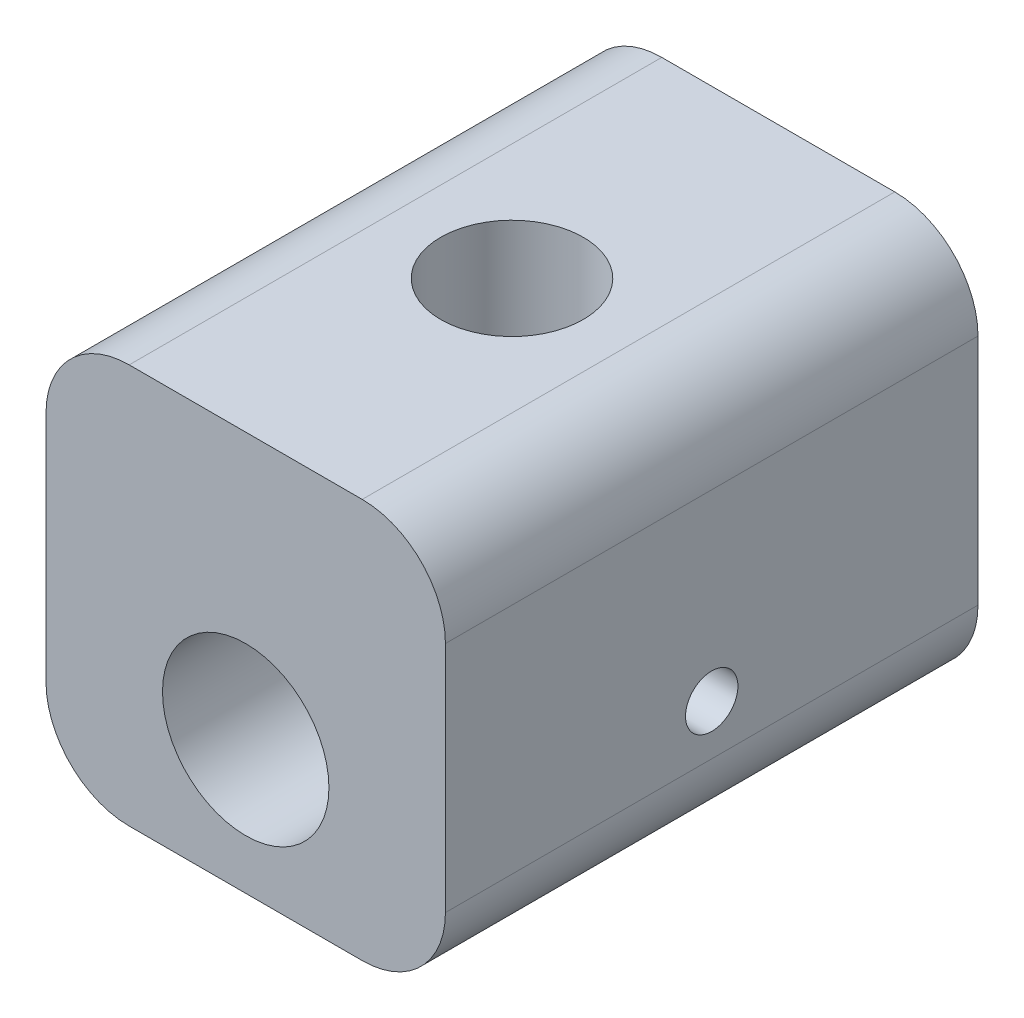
ISO-10303-21;
HEADER;
FILE_DESCRIPTION(('STEP AP214'),'2;1');
FILE_NAME('part.step','',(''),(''),'','','');
FILE_SCHEMA(('AUTOMOTIVE_DESIGN { 1 0 10303 214 1 1 1 1 }'));
ENDSEC;
DATA;
#1=APPLICATION_CONTEXT('core data for automotive mechanical design processes');
#2=APPLICATION_PROTOCOL_DEFINITION('international standard','automotive_design',2000,#1);
#3=PRODUCT_CONTEXT('',#1,'mechanical');
#4=PRODUCT('Part','Part','',(#3));
#5=PRODUCT_RELATED_PRODUCT_CATEGORY('part','',(#4));
#6=PRODUCT_DEFINITION_FORMATION('','',#4);
#7=PRODUCT_DEFINITION_CONTEXT('part definition',#1,'design');
#8=PRODUCT_DEFINITION('design','',#6,#7);
#9=PRODUCT_DEFINITION_SHAPE('','',#8);
#10=(LENGTH_UNIT() NAMED_UNIT(*) SI_UNIT(.MILLI.,.METRE.));
#11=(NAMED_UNIT(*) PLANE_ANGLE_UNIT() SI_UNIT($,.RADIAN.));
#12=(NAMED_UNIT(*) SI_UNIT($,.STERADIAN.) SOLID_ANGLE_UNIT());
#13=UNCERTAINTY_MEASURE_WITH_UNIT(LENGTH_MEASURE(1.E-05),#10,'distance_accuracy_value','');
#14=(GEOMETRIC_REPRESENTATION_CONTEXT(3) GLOBAL_UNCERTAINTY_ASSIGNED_CONTEXT((#13)) GLOBAL_UNIT_ASSIGNED_CONTEXT((#10,
#11,#12)) REPRESENTATION_CONTEXT('',''));
#15=CARTESIAN_POINT('',(0.,0.,0.));
#16=DIRECTION('',(0.,0.,1.));
#17=DIRECTION('',(1.,0.,0.));
#18=AXIS2_PLACEMENT_3D('',#15,#16,#17);
#19=CARTESIAN_POINT('',(0.,0.,25.4));
#20=DIRECTION('',(0.,0.,1.));
#21=DIRECTION('',(1.,0.,0.));
#22=AXIS2_PLACEMENT_3D('',#19,#20,#21);
#23=PLANE('',#22);
#24=DIRECTION('',(1.,0.,0.));
#25=VECTOR('',#24,1.);
#26=CARTESIAN_POINT('',(-9.525,-6.35,25.4));
#27=LINE('',#26,#25);
#28=CARTESIAN_POINT('',(-5.55625,-6.35,25.4));
#29=VERTEX_POINT('',#28);
#30=CARTESIAN_POINT('',(5.55625,-6.35,25.4));
#31=VERTEX_POINT('',#30);
#32=EDGE_CURVE('E169',#29,#31,#27,.T.);
#33=ORIENTED_EDGE('',*,*,#32,.T.);
#34=CARTESIAN_POINT('',(5.55625,-2.38125,25.4));
#35=DIRECTION('',(0.,0.,1.));
#36=DIRECTION('',(1.,0.,0.));
#37=AXIS2_PLACEMENT_3D('',#34,#35,#36);
#38=CIRCLE('',#37,3.96875);
#39=CARTESIAN_POINT('',(9.525,-2.38125,25.4));
#40=VERTEX_POINT('',#39);
#41=EDGE_CURVE('E147',#31,#40,#38,.T.);
#42=ORIENTED_EDGE('',*,*,#41,.T.);
#43=DIRECTION('',(0.,1.,0.));
#44=VECTOR('',#43,1.);
#45=CARTESIAN_POINT('',(9.525,12.7,25.4));
#46=LINE('',#45,#44);
#47=CARTESIAN_POINT('',(9.525,8.73125,25.4));
#48=VERTEX_POINT('',#47);
#49=EDGE_CURVE('E117',#40,#48,#46,.T.);
#50=ORIENTED_EDGE('',*,*,#49,.T.);
#51=CARTESIAN_POINT('',(5.55625,8.73125,25.4));
#52=DIRECTION('',(0.,0.,1.));
#53=DIRECTION('',(1.,0.,0.));
#54=AXIS2_PLACEMENT_3D('',#51,#52,#53);
#55=CIRCLE('',#54,3.96875);
#56=CARTESIAN_POINT('',(5.55625,12.7,25.4));
#57=VERTEX_POINT('',#56);
#58=EDGE_CURVE('E53',#48,#57,#55,.T.);
#59=ORIENTED_EDGE('',*,*,#58,.T.);
#60=DIRECTION('',(-1.,0.,0.));
#61=VECTOR('',#60,1.);
#62=CARTESIAN_POINT('',(-9.525,12.7,25.4));
#63=LINE('',#62,#61);
#64=CARTESIAN_POINT('',(-5.55625,12.7,25.4));
#65=VERTEX_POINT('',#64);
#66=EDGE_CURVE('E133',#57,#65,#63,.T.);
#67=ORIENTED_EDGE('',*,*,#66,.T.);
#68=CARTESIAN_POINT('',(-5.55625,8.73125,25.4));
#69=DIRECTION('',(0.,0.,1.));
#70=DIRECTION('',(1.,0.,0.));
#71=AXIS2_PLACEMENT_3D('',#68,#69,#70);
#72=CIRCLE('',#71,3.96875);
#73=CARTESIAN_POINT('',(-9.525,8.73125,25.4));
#74=VERTEX_POINT('',#73);
#75=EDGE_CURVE('E143',#65,#74,#72,.T.);
#76=ORIENTED_EDGE('',*,*,#75,.T.);
#77=DIRECTION('',(0.,-1.,0.));
#78=VECTOR('',#77,1.);
#79=CARTESIAN_POINT('',(-9.525,12.7,25.4));
#80=LINE('',#79,#78);
#81=CARTESIAN_POINT('',(-9.525,-2.38125,25.4));
#82=VERTEX_POINT('',#81);
#83=EDGE_CURVE('E127',#74,#82,#80,.T.);
#84=ORIENTED_EDGE('',*,*,#83,.T.);
#85=CARTESIAN_POINT('',(-5.55625,-2.38125,25.4));
#86=DIRECTION('',(0.,0.,1.));
#87=DIRECTION('',(1.,0.,0.));
#88=AXIS2_PLACEMENT_3D('',#85,#86,#87);
#89=CIRCLE('',#88,3.96875);
#90=EDGE_CURVE('E145',#82,#29,#89,.T.);
#91=ORIENTED_EDGE('',*,*,#90,.T.);
#92=EDGE_LOOP('',(#33,#42,#50,#59,#67,#76,#84,#91));
#93=FACE_BOUND('',#92,.T.);
#94=CARTESIAN_POINT('',(0.,0.,25.4));
#95=DIRECTION('',(0.,0.,1.));
#96=DIRECTION('',(1.,0.,0.));
#97=AXIS2_PLACEMENT_3D('',#94,#95,#96);
#98=CIRCLE('',#97,3.96875);
#99=CARTESIAN_POINT('',(3.96875,0.,25.4));
#100=VERTEX_POINT('',#99);
#101=EDGE_CURVE('E178',#100,#100,#98,.T.);
#102=ORIENTED_EDGE('',*,*,#101,.F.);
#103=EDGE_LOOP('',(#102));
#104=FACE_BOUND('',#103,.T.);
#105=ADVANCED_FACE('F33',(#93,#104),#23,.T.);
#106=CARTESIAN_POINT('',(0.,0.,0.));
#107=DIRECTION('',(0.,0.,1.));
#108=DIRECTION('',(1.,0.,0.));
#109=AXIS2_PLACEMENT_3D('',#106,#107,#108);
#110=PLANE('',#109);
#111=DIRECTION('',(0.,1.,0.));
#112=VECTOR('',#111,1.);
#113=CARTESIAN_POINT('',(9.525,12.7,0.));
#114=LINE('',#113,#112);
#115=CARTESIAN_POINT('',(9.525,-2.38125,0.));
#116=VERTEX_POINT('',#115);
#117=CARTESIAN_POINT('',(9.525,8.73125,0.));
#118=VERTEX_POINT('',#117);
#119=EDGE_CURVE('E115',#116,#118,#114,.T.);
#120=ORIENTED_EDGE('',*,*,#119,.F.);
#121=CARTESIAN_POINT('',(5.55625,-2.38125,0.));
#122=DIRECTION('',(0.,0.,1.));
#123=DIRECTION('',(1.,0.,0.));
#124=AXIS2_PLACEMENT_3D('',#121,#122,#123);
#125=CIRCLE('',#124,3.96875);
#126=CARTESIAN_POINT('',(5.55625,-6.35,0.));
#127=VERTEX_POINT('',#126);
#128=EDGE_CURVE('E98',#116,#127,#125,.F.);
#129=ORIENTED_EDGE('',*,*,#128,.T.);
#130=DIRECTION('',(1.,0.,0.));
#131=VECTOR('',#130,1.);
#132=CARTESIAN_POINT('',(-9.525,-6.35,0.));
#133=LINE('',#132,#131);
#134=CARTESIAN_POINT('',(-5.55625,-6.35,0.));
#135=VERTEX_POINT('',#134);
#136=EDGE_CURVE('E125',#135,#127,#133,.T.);
#137=ORIENTED_EDGE('',*,*,#136,.F.);
#138=CARTESIAN_POINT('',(-5.55625,-2.38125,0.));
#139=DIRECTION('',(0.,0.,1.));
#140=DIRECTION('',(1.,0.,0.));
#141=AXIS2_PLACEMENT_3D('',#138,#139,#140);
#142=CIRCLE('',#141,3.96875);
#143=CARTESIAN_POINT('',(-9.525,-2.38125,0.));
#144=VERTEX_POINT('',#143);
#145=EDGE_CURVE('E109',#135,#144,#142,.F.);
#146=ORIENTED_EDGE('',*,*,#145,.T.);
#147=DIRECTION('',(0.,-1.,0.));
#148=VECTOR('',#147,1.);
#149=CARTESIAN_POINT('',(-9.525,12.7,0.));
#150=LINE('',#149,#148);
#151=CARTESIAN_POINT('',(-9.525,8.73125,0.));
#152=VERTEX_POINT('',#151);
#153=EDGE_CURVE('E129',#152,#144,#150,.T.);
#154=ORIENTED_EDGE('',*,*,#153,.F.);
#155=CARTESIAN_POINT('',(-5.55625,8.73125,0.));
#156=DIRECTION('',(0.,0.,1.));
#157=DIRECTION('',(1.,0.,0.));
#158=AXIS2_PLACEMENT_3D('',#155,#156,#157);
#159=CIRCLE('',#158,3.96875);
#160=CARTESIAN_POINT('',(-5.55625,12.7,0.));
#161=VERTEX_POINT('',#160);
#162=EDGE_CURVE('E136',#152,#161,#159,.F.);
#163=ORIENTED_EDGE('',*,*,#162,.T.);
#164=DIRECTION('',(-1.,0.,0.));
#165=VECTOR('',#164,1.);
#166=CARTESIAN_POINT('',(-9.525,12.7,0.));
#167=LINE('',#166,#165);
#168=CARTESIAN_POINT('',(5.55625,12.7,0.));
#169=VERTEX_POINT('',#168);
#170=EDGE_CURVE('E124',#169,#161,#167,.T.);
#171=ORIENTED_EDGE('',*,*,#170,.F.);
#172=CARTESIAN_POINT('',(5.55625,8.73125,0.));
#173=DIRECTION('',(0.,0.,1.));
#174=DIRECTION('',(1.,0.,0.));
#175=AXIS2_PLACEMENT_3D('',#172,#173,#174);
#176=CIRCLE('',#175,3.96875);
#177=EDGE_CURVE('E118',#169,#118,#176,.F.);
#178=ORIENTED_EDGE('',*,*,#177,.T.);
#179=EDGE_LOOP('',(#120,#129,#137,#146,#154,#163,#171,#178));
#180=FACE_BOUND('',#179,.T.);
#181=CARTESIAN_POINT('',(0.,0.,0.));
#182=DIRECTION('',(0.,0.,1.));
#183=DIRECTION('',(1.,0.,0.));
#184=AXIS2_PLACEMENT_3D('',#181,#182,#183);
#185=CIRCLE('',#184,3.96875);
#186=CARTESIAN_POINT('',(3.96875,0.,0.));
#187=VERTEX_POINT('',#186);
#188=EDGE_CURVE('E174',#187,#187,#185,.T.);
#189=ORIENTED_EDGE('',*,*,#188,.T.);
#190=EDGE_LOOP('',(#189));
#191=FACE_BOUND('',#190,.T.);
#192=ADVANCED_FACE('F121',(#180,#191),#110,.F.);
#193=CARTESIAN_POINT('',(-9.525,12.7,25.4));
#194=DIRECTION('',(1.,0.,0.));
#195=DIRECTION('',(0.,1.,0.));
#196=AXIS2_PLACEMENT_3D('',#193,#194,#195);
#197=PLANE('',#196);
#198=ORIENTED_EDGE('',*,*,#153,.T.);
#199=DIRECTION('',(0.,0.,-1.));
#200=VECTOR('',#199,1.);
#201=CARTESIAN_POINT('',(-9.525,-2.38125,25.4));
#202=LINE('',#201,#200);
#203=EDGE_CURVE('E152',#144,#82,#202,.F.);
#204=ORIENTED_EDGE('',*,*,#203,.T.);
#205=ORIENTED_EDGE('',*,*,#83,.F.);
#206=DIRECTION('',(0.,0.,-1.));
#207=VECTOR('',#206,1.);
#208=CARTESIAN_POINT('',(-9.525,8.73125,25.4));
#209=LINE('',#208,#207);
#210=EDGE_CURVE('E149',#74,#152,#209,.T.);
#211=ORIENTED_EDGE('',*,*,#210,.T.);
#212=EDGE_LOOP('',(#198,#204,#205,#211));
#213=FACE_BOUND('',#212,.T.);
#214=ADVANCED_FACE('F165',(#213),#197,.F.);
#215=CARTESIAN_POINT('',(-9.525,-6.35,25.4));
#216=DIRECTION('',(0.,1.,0.));
#217=DIRECTION('',(0.,0.,1.));
#218=AXIS2_PLACEMENT_3D('',#215,#216,#217);
#219=PLANE('',#218);
#220=ORIENTED_EDGE('',*,*,#136,.T.);
#221=DIRECTION('',(0.,0.,-1.));
#222=VECTOR('',#221,1.);
#223=CARTESIAN_POINT('',(5.55625,-6.35,25.4));
#224=LINE('',#223,#222);
#225=EDGE_CURVE('E103',#127,#31,#224,.F.);
#226=ORIENTED_EDGE('',*,*,#225,.T.);
#227=ORIENTED_EDGE('',*,*,#32,.F.);
#228=DIRECTION('',(0.,0.,-1.));
#229=VECTOR('',#228,1.);
#230=CARTESIAN_POINT('',(-5.55625,-6.35,25.4));
#231=LINE('',#230,#229);
#232=EDGE_CURVE('E108',#29,#135,#231,.T.);
#233=ORIENTED_EDGE('',*,*,#232,.T.);
#234=EDGE_LOOP('',(#220,#226,#227,#233));
#235=FACE_BOUND('',#234,.T.);
#236=ADVANCED_FACE('F218',(#235),#219,.F.);
#237=CARTESIAN_POINT('',(9.525,12.7,25.4));
#238=DIRECTION('',(-1.,0.,0.));
#239=DIRECTION('',(0.,-1.,0.));
#240=AXIS2_PLACEMENT_3D('',#237,#238,#239);
#241=PLANE('',#240);
#242=CARTESIAN_POINT('',(9.525,0.,12.7));
#243=DIRECTION('',(1.,0.,0.));
#244=DIRECTION('',(0.,0.,-1.));
#245=AXIS2_PLACEMENT_3D('',#242,#243,#244);
#246=CIRCLE('',#245,1.25);
#247=CARTESIAN_POINT('',(9.525,0.,11.45));
#248=VERTEX_POINT('',#247);
#249=EDGE_CURVE('E211',#248,#248,#246,.T.);
#250=ORIENTED_EDGE('',*,*,#249,.F.);
#251=EDGE_LOOP('',(#250));
#252=FACE_BOUND('',#251,.T.);
#253=ORIENTED_EDGE('',*,*,#49,.F.);
#254=DIRECTION('',(0.,0.,-1.));
#255=VECTOR('',#254,1.);
#256=CARTESIAN_POINT('',(9.525,-2.38125,25.4));
#257=LINE('',#256,#255);
#258=EDGE_CURVE('E102',#40,#116,#257,.T.);
#259=ORIENTED_EDGE('',*,*,#258,.T.);
#260=ORIENTED_EDGE('',*,*,#119,.T.);
#261=DIRECTION('',(0.,0.,-1.));
#262=VECTOR('',#261,1.);
#263=CARTESIAN_POINT('',(9.525,8.73125,25.4));
#264=LINE('',#263,#262);
#265=EDGE_CURVE('E119',#118,#48,#264,.F.);
#266=ORIENTED_EDGE('',*,*,#265,.T.);
#267=EDGE_LOOP('',(#253,#259,#260,#266));
#268=FACE_BOUND('',#267,.T.);
#269=ADVANCED_FACE('F114',(#252,#268),#241,.F.);
#270=CARTESIAN_POINT('',(-9.525,12.7,25.4));
#271=DIRECTION('',(0.,-1.,0.));
#272=DIRECTION('',(0.,0.,-1.));
#273=AXIS2_PLACEMENT_3D('',#270,#271,#272);
#274=PLANE('',#273);
#275=CARTESIAN_POINT('',(0.,12.7,12.7));
#276=DIRECTION('',(0.,1.,0.));
#277=DIRECTION('',(0.,0.,1.));
#278=AXIS2_PLACEMENT_3D('',#275,#276,#277);
#279=CIRCLE('',#278,3.39999999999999);
#280=CARTESIAN_POINT('',(0.,12.7,16.1));
#281=VERTEX_POINT('',#280);
#282=EDGE_CURVE('E192',#281,#281,#279,.T.);
#283=ORIENTED_EDGE('',*,*,#282,.F.);
#284=EDGE_LOOP('',(#283));
#285=FACE_BOUND('',#284,.T.);
#286=ORIENTED_EDGE('',*,*,#170,.T.);
#287=DIRECTION('',(0.,0.,-1.));
#288=VECTOR('',#287,1.);
#289=CARTESIAN_POINT('',(-5.55625,12.7,25.4));
#290=LINE('',#289,#288);
#291=EDGE_CURVE('E11',#161,#65,#290,.F.);
#292=ORIENTED_EDGE('',*,*,#291,.T.);
#293=ORIENTED_EDGE('',*,*,#66,.F.);
#294=DIRECTION('',(0.,0.,-1.));
#295=VECTOR('',#294,1.);
#296=CARTESIAN_POINT('',(5.55625,12.7,25.4));
#297=LINE('',#296,#295);
#298=EDGE_CURVE('E41',#57,#169,#297,.T.);
#299=ORIENTED_EDGE('',*,*,#298,.T.);
#300=EDGE_LOOP('',(#286,#292,#293,#299));
#301=FACE_BOUND('',#300,.T.);
#302=ADVANCED_FACE('F155',(#285,#301),#274,.F.);
#303=CARTESIAN_POINT('',(0.,0.,25.4));
#304=DIRECTION('',(0.,0.,-1.));
#305=DIRECTION('',(-1.,0.,0.));
#306=AXIS2_PLACEMENT_3D('',#303,#304,#305);
#307=CYLINDRICAL_SURFACE('',#306,3.96875);
#308=CARTESIAN_POINT('',(3.96875,0.,11.45));
#309=CARTESIAN_POINT('',(3.96874971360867,-0.0684121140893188,11.4500003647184));
#310=CARTESIAN_POINT('',(3.96696444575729,-0.13682815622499,11.4556347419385));
#311=CARTESIAN_POINT('',(3.96001767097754,-0.271657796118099,11.4779631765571));
#312=CARTESIAN_POINT('',(3.95485544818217,-0.338070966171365,11.4946595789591));
#313=CARTESIAN_POINT('',(3.94171835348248,-0.466931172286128,11.5384919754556));
#314=CARTESIAN_POINT('',(3.93374787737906,-0.529384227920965,11.5656116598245));
#315=CARTESIAN_POINT('',(3.91581614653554,-0.648856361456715,11.6294509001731));
#316=CARTESIAN_POINT('',(3.90585456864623,-0.705874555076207,11.6661720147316));
#317=CARTESIAN_POINT('',(3.88464802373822,-0.814644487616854,11.7493821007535));
#318=CARTESIAN_POINT('',(3.87337476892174,-0.866202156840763,11.7961175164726));
#319=CARTESIAN_POINT('',(3.85097831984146,-0.960892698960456,11.8975049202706));
#320=CARTESIAN_POINT('',(3.83985515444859,-1.00402397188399,11.9521584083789));
#321=CARTESIAN_POINT('',(3.81871387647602,-1.08169602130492,12.069518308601));
#322=CARTESIAN_POINT('',(3.80873062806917,-1.11599322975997,12.1323927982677));
#323=CARTESIAN_POINT('',(3.7914255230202,-1.17344616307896,12.2633824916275));
#324=CARTESIAN_POINT('',(3.78410295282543,-1.19660487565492,12.3314962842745));
#325=CARTESIAN_POINT('',(3.77324441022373,-1.23041123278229,12.4688391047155));
#326=CARTESIAN_POINT('',(3.7695996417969,-1.2414193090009,12.5379705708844));
#327=CARTESIAN_POINT('',(3.76618649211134,-1.2517380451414,12.6771878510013));
#328=CARTESIAN_POINT('',(3.76641706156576,-1.25105187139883,12.7472734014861));
#329=CARTESIAN_POINT('',(3.7706325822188,-1.23828325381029,12.8834174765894));
#330=CARTESIAN_POINT('',(3.77446613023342,-1.22666036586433,12.9495245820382));
#331=CARTESIAN_POINT('',(3.78520949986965,-1.19309388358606,13.0787980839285));
#332=CARTESIAN_POINT('',(3.79211965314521,-1.171149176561,13.1419641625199));
#333=CARTESIAN_POINT('',(3.80835271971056,-1.11724021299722,13.2646514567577));
#334=CARTESIAN_POINT('',(3.81770979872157,-1.08513259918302,13.324104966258));
#335=CARTESIAN_POINT('',(3.83776691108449,-1.011908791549,13.4369304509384));
#336=CARTESIAN_POINT('',(3.84846729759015,-0.970790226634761,13.4903008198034));
#337=CARTESIAN_POINT('',(3.87061140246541,-0.878462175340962,13.5920413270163));
#338=CARTESIAN_POINT('',(3.88206660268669,-0.826873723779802,13.6400657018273));
#339=CARTESIAN_POINT('',(3.90399323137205,-0.716233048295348,13.7268662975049));
#340=CARTESIAN_POINT('',(3.91446458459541,-0.657180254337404,13.7656418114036));
#341=CARTESIAN_POINT('',(3.93335664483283,-0.532613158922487,13.8330832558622));
#342=CARTESIAN_POINT('',(3.94176021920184,-0.467050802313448,13.8616655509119));
#343=CARTESIAN_POINT('',(3.95544612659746,-0.331722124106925,13.9072924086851));
#344=CARTESIAN_POINT('',(3.96072942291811,-0.261957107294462,13.9243405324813));
#345=CARTESIAN_POINT('',(3.9674239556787,-0.123137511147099,13.9458234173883));
#346=CARTESIAN_POINT('',(3.96897877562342,-0.0541621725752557,13.950726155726));
#347=CARTESIAN_POINT('',(3.96846651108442,0.0836337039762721,13.9491001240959));
#348=CARTESIAN_POINT('',(3.96639996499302,0.152454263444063,13.94257305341));
#349=CARTESIAN_POINT('',(3.95897157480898,0.286174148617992,13.9186477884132));
#350=CARTESIAN_POINT('',(3.95369450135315,0.351128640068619,13.9015290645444));
#351=CARTESIAN_POINT('',(3.94046393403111,0.477224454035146,13.8572484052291));
#352=CARTESIAN_POINT('',(3.93251010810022,0.538365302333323,13.8300852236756));
#353=CARTESIAN_POINT('',(3.91449910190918,0.656772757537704,13.7657398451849));
#354=CARTESIAN_POINT('',(3.90439496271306,0.713906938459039,13.728327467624));
#355=CARTESIAN_POINT('',(3.8832376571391,0.821242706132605,13.6448211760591));
#356=CARTESIAN_POINT('',(3.87218422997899,0.871442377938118,13.598724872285));
#357=CARTESIAN_POINT('',(3.84981311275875,0.965584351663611,13.4969579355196));
#358=CARTESIAN_POINT('',(3.83850271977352,1.00919303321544,13.4409763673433));
#359=CARTESIAN_POINT('',(3.81736280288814,1.08642843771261,13.3222443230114));
#360=CARTESIAN_POINT('',(3.80753325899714,1.12005529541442,13.2594939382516));
#361=CARTESIAN_POINT('',(3.7905758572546,1.17616857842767,13.1291192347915));
#362=CARTESIAN_POINT('',(3.78343805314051,1.19869611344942,13.0615139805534));
#363=CARTESIAN_POINT('',(3.7727378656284,1.23196464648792,12.9231981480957));
#364=CARTESIAN_POINT('',(3.76917409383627,1.24271022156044,12.8524887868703));
#365=CARTESIAN_POINT('',(3.76617169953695,1.25177774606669,12.7134640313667));
#366=CARTESIAN_POINT('',(3.76655110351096,1.25064771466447,12.6451878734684));
#367=CARTESIAN_POINT('',(3.77094933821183,1.23732201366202,12.5098496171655));
#368=CARTESIAN_POINT('',(3.77496799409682,1.2251268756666,12.4427874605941));
#369=CARTESIAN_POINT('',(3.78606378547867,1.19038650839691,12.3127778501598));
#370=CARTESIAN_POINT('',(3.7930937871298,1.16800046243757,12.2497835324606));
#371=CARTESIAN_POINT('',(3.80940748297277,1.11363944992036,12.1283949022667));
#372=CARTESIAN_POINT('',(3.81869164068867,1.08166251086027,12.0700015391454));
#373=CARTESIAN_POINT('',(3.83892685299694,1.00754479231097,11.9569654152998));
#374=CARTESIAN_POINT('',(3.84992940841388,0.965051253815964,11.9025632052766));
#375=CARTESIAN_POINT('',(3.87212739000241,0.871724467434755,11.8014842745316));
#376=CARTESIAN_POINT('',(3.8833228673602,0.820888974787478,11.754809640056));
#377=CARTESIAN_POINT('',(3.90509331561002,0.710281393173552,11.6689508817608));
#378=CARTESIAN_POINT('',(3.91563512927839,0.65026776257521,11.6300685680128));
#379=CARTESIAN_POINT('',(3.93449062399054,0.524224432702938,11.5629950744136));
#380=CARTESIAN_POINT('',(3.94280514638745,0.458197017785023,11.534799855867));
#381=CARTESIAN_POINT('',(3.95571944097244,0.327452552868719,11.4918507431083));
#382=CARTESIAN_POINT('',(3.96056304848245,0.263052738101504,11.4762024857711));
#383=CARTESIAN_POINT('',(3.96707813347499,0.132436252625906,11.4552780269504));
#384=CARTESIAN_POINT('',(3.96875027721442,0.0662199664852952,11.4499996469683));
#385=CARTESIAN_POINT('',(3.96875,0.,11.45));
#386=B_SPLINE_CURVE_WITH_KNOTS('',3,(#308,#309,#310,#311,#312,#313,#314,#315,#316,#317,#318,
#319,#320,#321,#322,#323,#324,#325,#326,#327,#328,#329,#330,#331,#332,#333,#334,#335,#336,#337,
#338,#339,#340,#341,#342,#343,#344,#345,#346,#347,#348,#349,#350,#351,#352,#353,#354,#355,#356,
#357,#358,#359,#360,#361,#362,#363,#364,#365,#366,#367,#368,#369,#370,#371,#372,#373,#374,#375,
#376,#377,#378,#379,#380,#381,#382,#383,#384,#385),.UNSPECIFIED.,.T.,.F.,(4,2,2,2,2,2,2,2,2,2,2,
2,2,2,2,2,2,2,2,2,2,2,2,2,2,2,2,2,2,2,2,2,2,2,2,2,2,2,4),(0.,0.204992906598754,
0.410029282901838,0.614746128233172,0.819496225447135,1.03002540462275,1.24059451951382,
1.45646405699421,1.67227565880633,1.88149747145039,2.09066263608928,2.29141357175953,
2.49218615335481,2.69592748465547,2.89972249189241,3.11294999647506,3.32619379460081,
3.54114905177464,3.75603791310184,3.96250827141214,4.16894793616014,4.37016001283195,
4.57139706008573,4.77758803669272,4.98383583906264,5.19839381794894,5.41294890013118,
5.62670322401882,5.84037447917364,6.04423049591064,6.24807671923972,6.4488426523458,
6.6496499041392,6.85842006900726,7.06724650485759,7.28303905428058,7.49874997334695,
7.69721593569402,7.89564019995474),.UNSPECIFIED.);
#387=CARTESIAN_POINT('',(3.96875,0.,11.45));
#388=VERTEX_POINT('',#387);
#389=EDGE_CURVE('E205',#388,#388,#386,.T.);
#390=ORIENTED_EDGE('',*,*,#389,.F.);
#391=EDGE_LOOP('',(#390));
#392=FACE_BOUND('',#391,.T.);
#393=CARTESIAN_POINT('',(0.,3.96875,16.1));
#394=CARTESIAN_POINT('',(-0.0800927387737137,3.96875342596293,16.1000035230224));
#395=CARTESIAN_POINT('',(-0.160158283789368,3.96632240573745,16.097167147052));
#396=CARTESIAN_POINT('',(-0.319627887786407,3.95666386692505,16.0858856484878));
#397=CARTESIAN_POINT('',(-0.399031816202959,3.9494354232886,16.0774394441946));
#398=CARTESIAN_POINT('',(-0.556542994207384,3.93033507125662,16.0550843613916));
#399=CARTESIAN_POINT('',(-0.634649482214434,3.91846052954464,16.0411723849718));
#400=CARTESIAN_POINT('',(-0.788960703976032,3.89033196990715,16.0081384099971));
#401=CARTESIAN_POINT('',(-0.865164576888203,3.87407600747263,15.9890140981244));
#402=CARTESIAN_POINT('',(-1.08914662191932,3.8194470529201,15.9245509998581));
#403=CARTESIAN_POINT('',(-1.23346300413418,3.77506420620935,15.8719498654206));
#404=CARTESIAN_POINT('',(-1.50975731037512,3.67333485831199,15.7501673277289));
#405=CARTESIAN_POINT('',(-1.64173123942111,3.61598418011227,15.6809805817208));
#406=CARTESIAN_POINT('',(-1.93980224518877,3.46774978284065,15.4996502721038));
#407=CARTESIAN_POINT('',(-2.09986666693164,3.37239622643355,15.3811653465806));
#408=CARTESIAN_POINT('',(-2.3200073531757,3.22126532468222,15.1874063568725));
#409=CARTESIAN_POINT('',(-2.39017052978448,3.16943694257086,15.1200113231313));
#410=CARTESIAN_POINT('',(-2.52387693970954,3.06402467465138,14.9802160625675));
#411=CARTESIAN_POINT('',(-2.58742249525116,3.01044141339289,14.9078176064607));
#412=CARTESIAN_POINT('',(-2.70914023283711,2.901439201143,14.756737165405));
#413=CARTESIAN_POINT('',(-2.76717671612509,2.84600508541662,14.6779572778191));
#414=CARTESIAN_POINT('',(-2.8764078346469,2.73555918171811,14.5154519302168));
#415=CARTESIAN_POINT('',(-2.92760021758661,2.6805475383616,14.4317248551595));
#416=CARTESIAN_POINT('',(-3.02291913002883,2.57256827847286,14.2593721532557));
#417=CARTESIAN_POINT('',(-3.06706040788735,2.51959657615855,14.1707572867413));
#418=CARTESIAN_POINT('',(-3.14810230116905,2.41757455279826,13.9881831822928));
#419=CARTESIAN_POINT('',(-3.18500876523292,2.36852108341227,13.8942283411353));
#420=CARTESIAN_POINT('',(-3.25295386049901,2.27438238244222,13.6949889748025));
#421=CARTESIAN_POINT('',(-3.28354111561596,2.22967987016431,13.5893641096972));
#422=CARTESIAN_POINT('',(-3.33488718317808,2.15213630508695,13.3715353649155));
#423=CARTESIAN_POINT('',(-3.35566620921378,2.11927089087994,13.2593455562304));
#424=CARTESIAN_POINT('',(-3.37849179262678,2.0825414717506,13.0863450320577));
#425=CARTESIAN_POINT('',(-3.38472524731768,2.07236357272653,13.0273999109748));
#426=CARTESIAN_POINT('',(-3.39411411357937,2.05695152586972,12.9086382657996));
#427=CARTESIAN_POINT('',(-3.3972712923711,2.05171453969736,12.8488222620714));
#428=CARTESIAN_POINT('',(-3.40040556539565,2.04651624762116,12.7289116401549));
#429=CARTESIAN_POINT('',(-3.40038467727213,2.04655159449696,12.6688172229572));
#430=CARTESIAN_POINT('',(-3.39717337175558,2.05187625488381,12.5489615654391));
#431=CARTESIAN_POINT('',(-3.39398300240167,2.05716548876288,12.4892003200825));
#432=CARTESIAN_POINT('',(-3.38124948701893,2.07807122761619,12.3295091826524));
#433=CARTESIAN_POINT('',(-3.36883849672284,2.09830056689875,12.2303885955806));
#434=CARTESIAN_POINT('',(-3.33608571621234,2.14998114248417,12.03647792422));
#435=CARTESIAN_POINT('',(-3.3157300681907,2.18145197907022,11.9416957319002));
#436=CARTESIAN_POINT('',(-3.27009574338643,2.24921593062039,11.7650921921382));
#437=CARTESIAN_POINT('',(-3.24539822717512,2.2848527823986,11.6828601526));
#438=CARTESIAN_POINT('',(-3.19065870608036,2.36069104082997,11.5223343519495));
#439=CARTESIAN_POINT('',(-3.16061251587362,2.40089601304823,11.4440437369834));
#440=CARTESIAN_POINT('',(-3.09544214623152,2.48435590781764,11.2910397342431));
#441=CARTESIAN_POINT('',(-3.06030590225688,2.52761794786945,11.2163354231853));
#442=CARTESIAN_POINT('',(-2.98521681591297,2.61587904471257,11.0705222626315));
#443=CARTESIAN_POINT('',(-2.94526517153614,2.66087766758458,10.9994125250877));
#444=CARTESIAN_POINT('',(-2.81149959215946,2.80434764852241,10.7800042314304));
#445=CARTESIAN_POINT('',(-2.70896652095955,2.9042943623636,10.6378568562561));
#446=CARTESIAN_POINT('',(-2.48203372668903,3.1004889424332,10.3697045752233));
#447=CARTESIAN_POINT('',(-2.35765915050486,3.19674090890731,10.2436813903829));
#448=CARTESIAN_POINT('',(-2.09386351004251,3.37501125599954,10.0158869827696));
#449=CARTESIAN_POINT('',(-1.95558212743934,3.45751261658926,9.91318717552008));
#450=CARTESIAN_POINT('',(-1.65960551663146,3.60890972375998,9.72743625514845));
#451=CARTESIAN_POINT('',(-1.50192909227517,3.67781848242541,9.64436633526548));
#452=CARTESIAN_POINT('',(-1.19868609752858,3.78619832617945,9.51482509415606));
#453=CARTESIAN_POINT('',(-1.05587459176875,3.82871618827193,9.46448521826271));
#454=CARTESIAN_POINT('',(-0.761248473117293,3.89798880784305,9.38280054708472));
#455=CARTESIAN_POINT('',(-0.609440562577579,3.92475514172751,9.35144180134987));
#456=CARTESIAN_POINT('',(-0.300142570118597,3.96045665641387,9.3096666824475));
#457=CARTESIAN_POINT('',(-0.14262990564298,3.96931069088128,9.2993456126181));
#458=CARTESIAN_POINT('',(0.172231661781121,3.96813411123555,9.30071881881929));
#459=CARTESIAN_POINT('',(0.329580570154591,3.95810414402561,9.31241234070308));
#460=CARTESIAN_POINT('',(0.627725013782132,3.92146389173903,9.35530071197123));
#461=CARTESIAN_POINT('',(0.76889487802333,3.89610471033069,9.38502458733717));
#462=CARTESIAN_POINT('',(1.04341100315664,3.83173157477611,9.46092724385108));
#463=CARTESIAN_POINT('',(1.17675603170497,3.79271547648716,9.50710860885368));
#464=CARTESIAN_POINT('',(1.44395731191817,3.69967345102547,9.61818083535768));
#465=CARTESIAN_POINT('',(1.57696324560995,3.64468082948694,9.68429306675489));
#466=CARTESIAN_POINT('',(1.82987170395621,3.52451591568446,9.83068563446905));
#467=CARTESIAN_POINT('',(1.94976388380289,3.45933568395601,9.91097702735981));
#468=CARTESIAN_POINT('',(2.23296665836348,3.28700004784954,10.127127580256));
#469=CARTESIAN_POINT('',(2.38774691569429,3.17523332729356,10.2706111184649));
#470=CARTESIAN_POINT('',(2.59671172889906,3.00271682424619,10.5027354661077));
#471=CARTESIAN_POINT('',(2.66258519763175,2.94430353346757,10.5830679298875));
#472=CARTESIAN_POINT('',(2.78664735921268,2.82715822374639,10.7492712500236));
#473=CARTESIAN_POINT('',(2.84483855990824,2.768426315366,10.835140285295));
#474=CARTESIAN_POINT('',(2.94083968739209,2.66574061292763,10.9918342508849));
#475=CARTESIAN_POINT('',(2.98024374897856,2.62152369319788,11.0615192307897));
#476=CARTESIAN_POINT('',(3.05439844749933,2.53473462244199,11.204299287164));
#477=CARTESIAN_POINT('',(3.08915013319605,2.49216210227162,11.2773935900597));
#478=CARTESIAN_POINT('',(3.15376034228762,2.40987574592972,11.4270417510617));
#479=CARTESIAN_POINT('',(3.1836297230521,2.37015567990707,11.5035874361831));
#480=CARTESIAN_POINT('',(3.23824848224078,2.29496881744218,11.6604607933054));
#481=CARTESIAN_POINT('',(3.26300100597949,2.25949941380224,11.7407861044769));
#482=CARTESIAN_POINT('',(3.31196582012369,2.18727424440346,11.9242250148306));
#483=CARTESIAN_POINT('',(3.33476700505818,2.15207053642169,12.0283573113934));
#484=CARTESIAN_POINT('',(3.37070953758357,2.09533931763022,12.2417822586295));
#485=CARTESIAN_POINT('',(3.38387566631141,2.07377674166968,12.3510608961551));
#486=CARTESIAN_POINT('',(3.39949487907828,2.04809067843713,12.5736661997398));
#487=CARTESIAN_POINT('',(3.4018398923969,2.04414312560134,12.6870223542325));
#488=CARTESIAN_POINT('',(3.39523184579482,2.05509119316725,12.9125167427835));
#489=CARTESIAN_POINT('',(3.38626779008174,2.07000515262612,13.0246536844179));
#490=CARTESIAN_POINT('',(3.35527211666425,2.11993024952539,13.2653519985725));
#491=CARTESIAN_POINT('',(3.33105147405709,2.15826593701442,13.392903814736));
#492=CARTESIAN_POINT('',(3.27007302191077,2.24957496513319,13.6396267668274));
#493=CARTESIAN_POINT('',(3.23327055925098,2.30260031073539,13.7587662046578));
#494=CARTESIAN_POINT('',(3.15562260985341,2.40760952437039,13.9698500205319));
#495=CARTESIAN_POINT('',(3.11642588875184,2.45834221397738,14.0630530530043));
#496=CARTESIAN_POINT('',(3.0307861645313,2.56318048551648,14.244142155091));
#497=CARTESIAN_POINT('',(2.9843385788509,2.61728818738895,14.332024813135));
#498=CARTESIAN_POINT('',(2.88437335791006,2.72706644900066,14.502828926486));
#499=CARTESIAN_POINT('',(2.83084629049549,2.78273901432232,14.5857435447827));
#500=CARTESIAN_POINT('',(2.71684736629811,2.89414405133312,14.746570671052));
#501=CARTESIAN_POINT('',(2.65637710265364,2.94987650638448,14.8244843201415));
#502=CARTESIAN_POINT('',(2.52539666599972,3.06287189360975,14.9788374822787));
#503=CARTESIAN_POINT('',(2.45454428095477,3.12008022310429,15.0550275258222));
#504=CARTESIAN_POINT('',(2.30512233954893,3.23204382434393,15.20147056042));
#505=CARTESIAN_POINT('',(2.22655126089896,3.28679860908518,15.2717223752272));
#506=CARTESIAN_POINT('',(2.0619038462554,3.39250218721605,15.4055072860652));
#507=CARTESIAN_POINT('',(1.97584743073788,3.44346045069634,15.4690572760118));
#508=CARTESIAN_POINT('',(1.79620797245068,3.5404857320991,15.5888220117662));
#509=CARTESIAN_POINT('',(1.702625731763,3.58655327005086,15.645037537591));
#510=CARTESIAN_POINT('',(1.47138716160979,3.68882652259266,15.768893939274));
#511=CARTESIAN_POINT('',(1.33044969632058,3.74227524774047,15.832812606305));
#512=CARTESIAN_POINT('',(1.03692257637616,3.83396755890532,15.9417892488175));
#513=CARTESIAN_POINT('',(0.884352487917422,3.87223603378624,15.9868781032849));
#514=CARTESIAN_POINT('',(0.609641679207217,3.92349291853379,16.0470880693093));
#515=CARTESIAN_POINT('',(0.489227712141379,3.94038138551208,16.0668490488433));
#516=CARTESIAN_POINT('',(0.24585463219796,3.96300777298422,16.0933028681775));
#517=CARTESIAN_POINT('',(0.122895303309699,3.96874474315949,16.0999945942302));
#518=CARTESIAN_POINT('',(0.,3.96875,16.1));
#519=B_SPLINE_CURVE_WITH_KNOTS('',3,(#393,#394,#395,#396,#397,#398,#399,#400,#401,#402,#403,
#404,#405,#406,#407,#408,#409,#410,#411,#412,#413,#414,#415,#416,#417,#418,#419,#420,#421,#422,
#423,#424,#425,#426,#427,#428,#429,#430,#431,#432,#433,#434,#435,#436,#437,#438,#439,#440,#441,
#442,#443,#444,#445,#446,#447,#448,#449,#450,#451,#452,#453,#454,#455,#456,#457,#458,#459,#460,
#461,#462,#463,#464,#465,#466,#467,#468,#469,#470,#471,#472,#473,#474,#475,#476,#477,#478,#479,
#480,#481,#482,#483,#484,#485,#486,#487,#488,#489,#490,#491,#492,#493,#494,#495,#496,#497,#498,
#499,#500,#501,#502,#503,#504,#505,#506,#507,#508,#509,#510,#511,#512,#513,#514,#515,#516,#517,
#518),.UNSPECIFIED.,.T.,.F.,(4,2,2,2,2,2,2,2,2,2,2,2,2,2,2,2,2,2,2,2,2,2,2,2,2,2,2,2,2,2,2,2,2,
2,2,2,2,2,2,2,2,2,2,2,2,2,2,2,2,2,2,2,2,2,2,2,2,2,2,2,2,2,4),(0.,0.240144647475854,
0.480335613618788,0.720662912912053,0.961097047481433,1.43844317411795,1.9159432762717,
2.57447719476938,2.90494412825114,3.23529470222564,3.57236936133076,3.90955467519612,
4.24602521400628,4.58222261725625,4.93748307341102,5.29200814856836,5.47218504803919,
5.65225838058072,5.83221739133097,6.01217367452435,6.31661103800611,6.62158181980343,
6.90006392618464,7.17876490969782,7.45813762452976,7.73744097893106,8.34075196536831,
8.94337283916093,9.51420761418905,10.0844932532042,10.5543795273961,11.0239200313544,
11.4955829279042,11.9672296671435,12.4047785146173,12.8423960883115,13.3158085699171,
13.7895918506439,14.5019089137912,14.8592048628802,15.216383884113,15.4905769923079,
15.7647081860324,16.0382212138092,16.3115656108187,16.6472601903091,16.9820883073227,
17.3202532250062,17.658747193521,18.0626017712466,18.4679047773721,18.8068420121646,
19.1459943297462,19.4856031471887,19.8251341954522,20.1809322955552,20.5368007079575,
20.8917494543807,21.2466604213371,21.7358269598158,22.2241881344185,22.5926376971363,
22.9611186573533),.UNSPECIFIED.);
#520=CARTESIAN_POINT('',(0.,3.96875,16.1));
#521=VERTEX_POINT('',#520);
#522=EDGE_CURVE('E183',#521,#521,#519,.T.);
#523=ORIENTED_EDGE('',*,*,#522,.F.);
#524=EDGE_LOOP('',(#523));
#525=FACE_BOUND('',#524,.T.);
#526=ORIENTED_EDGE('',*,*,#101,.T.);
#527=EDGE_LOOP('',(#526));
#528=FACE_BOUND('',#527,.T.);
#529=ORIENTED_EDGE('',*,*,#188,.F.);
#530=EDGE_LOOP('',(#529));
#531=FACE_BOUND('',#530,.T.);
#532=ADVANCED_FACE('F224',(#392,#525,#528,#531),#307,.F.);
#533=CARTESIAN_POINT('',(5.55625,-2.38125,25.4));
#534=DIRECTION('',(0.,0.,-1.));
#535=DIRECTION('',(-1.,0.,0.));
#536=AXIS2_PLACEMENT_3D('',#533,#534,#535);
#537=CYLINDRICAL_SURFACE('',#536,3.96875);
#538=ORIENTED_EDGE('',*,*,#41,.F.);
#539=ORIENTED_EDGE('',*,*,#225,.F.);
#540=ORIENTED_EDGE('',*,*,#128,.F.);
#541=ORIENTED_EDGE('',*,*,#258,.F.);
#542=EDGE_LOOP('',(#538,#539,#540,#541));
#543=FACE_BOUND('',#542,.T.);
#544=ADVANCED_FACE('F101',(#543),#537,.T.);
#545=CARTESIAN_POINT('',(-5.55625,-2.38125,25.4));
#546=DIRECTION('',(0.,0.,-1.));
#547=DIRECTION('',(-1.,0.,0.));
#548=AXIS2_PLACEMENT_3D('',#545,#546,#547);
#549=CYLINDRICAL_SURFACE('',#548,3.96875);
#550=ORIENTED_EDGE('',*,*,#90,.F.);
#551=ORIENTED_EDGE('',*,*,#203,.F.);
#552=ORIENTED_EDGE('',*,*,#145,.F.);
#553=ORIENTED_EDGE('',*,*,#232,.F.);
#554=EDGE_LOOP('',(#550,#551,#552,#553));
#555=FACE_BOUND('',#554,.T.);
#556=ADVANCED_FACE('F241',(#555),#549,.T.);
#557=CARTESIAN_POINT('',(-5.55625,8.73125,25.4));
#558=DIRECTION('',(0.,0.,-1.));
#559=DIRECTION('',(-1.,0.,0.));
#560=AXIS2_PLACEMENT_3D('',#557,#558,#559);
#561=CYLINDRICAL_SURFACE('',#560,3.96875);
#562=ORIENTED_EDGE('',*,*,#75,.F.);
#563=ORIENTED_EDGE('',*,*,#291,.F.);
#564=ORIENTED_EDGE('',*,*,#162,.F.);
#565=ORIENTED_EDGE('',*,*,#210,.F.);
#566=EDGE_LOOP('',(#562,#563,#564,#565));
#567=FACE_BOUND('',#566,.T.);
#568=ADVANCED_FACE('F162',(#567),#561,.T.);
#569=CARTESIAN_POINT('',(5.55625,8.73125,25.4));
#570=DIRECTION('',(0.,0.,-1.));
#571=DIRECTION('',(-1.,0.,0.));
#572=AXIS2_PLACEMENT_3D('',#569,#570,#571);
#573=CYLINDRICAL_SURFACE('',#572,3.96875);
#574=ORIENTED_EDGE('',*,*,#58,.F.);
#575=ORIENTED_EDGE('',*,*,#265,.F.);
#576=ORIENTED_EDGE('',*,*,#177,.F.);
#577=ORIENTED_EDGE('',*,*,#298,.F.);
#578=EDGE_LOOP('',(#574,#575,#576,#577));
#579=FACE_BOUND('',#578,.T.);
#580=ADVANCED_FACE('F35',(#579),#573,.T.);
#581=CARTESIAN_POINT('',(0.,12.7,12.7));
#582=DIRECTION('',(0.,1.,0.));
#583=DIRECTION('',(0.,0.,1.));
#584=AXIS2_PLACEMENT_3D('',#581,#582,#583);
#585=CYLINDRICAL_SURFACE('',#584,3.39999999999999);
#586=ORIENTED_EDGE('',*,*,#282,.T.);
#587=EDGE_LOOP('',(#586));
#588=FACE_BOUND('',#587,.T.);
#589=ORIENTED_EDGE('',*,*,#522,.T.);
#590=EDGE_LOOP('',(#589));
#591=FACE_BOUND('',#590,.T.);
#592=ADVANCED_FACE('F196',(#588,#591),#585,.F.);
#593=CARTESIAN_POINT('',(9.525,0.,12.7));
#594=DIRECTION('',(1.,0.,0.));
#595=DIRECTION('',(0.,0.,-1.));
#596=AXIS2_PLACEMENT_3D('',#593,#594,#595);
#597=CYLINDRICAL_SURFACE('',#596,1.25);
#598=ORIENTED_EDGE('',*,*,#249,.T.);
#599=EDGE_LOOP('',(#598));
#600=FACE_BOUND('',#599,.T.);
#601=ORIENTED_EDGE('',*,*,#389,.T.);
#602=EDGE_LOOP('',(#601));
#603=FACE_BOUND('',#602,.T.);
#604=ADVANCED_FACE('F200',(#600,#603),#597,.F.);
#605=CLOSED_SHELL('',(#105,#192,#214,#236,#269,#302,#532,#544,#556,#568,#580,#592,#604));
#606=MANIFOLD_SOLID_BREP('B2',#605);
#607=ADVANCED_BREP_SHAPE_REPRESENTATION('',(#18,#606),#14);
#608=SHAPE_DEFINITION_REPRESENTATION(#9,#607);
ENDSEC;
END-ISO-10303-21;
